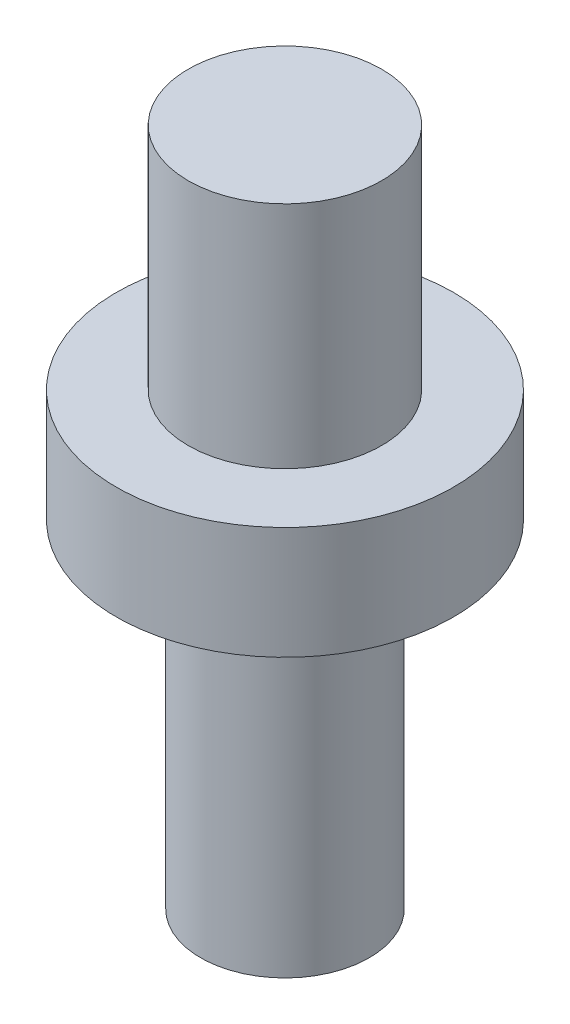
ISO-10303-21;
HEADER;
FILE_DESCRIPTION(('STEP AP214'),'2;1');
FILE_NAME('part.step','',(''),(''),'','','');
FILE_SCHEMA(('AUTOMOTIVE_DESIGN { 1 0 10303 214 1 1 1 1 }'));
ENDSEC;
DATA;
#1=APPLICATION_CONTEXT('core data for automotive mechanical design processes');
#2=APPLICATION_PROTOCOL_DEFINITION('international standard','automotive_design',2000,#1);
#3=PRODUCT_CONTEXT('',#1,'mechanical');
#4=PRODUCT('Part','Part','',(#3));
#5=PRODUCT_RELATED_PRODUCT_CATEGORY('part','',(#4));
#6=PRODUCT_DEFINITION_FORMATION('','',#4);
#7=PRODUCT_DEFINITION_CONTEXT('part definition',#1,'design');
#8=PRODUCT_DEFINITION('design','',#6,#7);
#9=PRODUCT_DEFINITION_SHAPE('','',#8);
#10=(LENGTH_UNIT() NAMED_UNIT(*) SI_UNIT(.MILLI.,.METRE.));
#11=(NAMED_UNIT(*) PLANE_ANGLE_UNIT() SI_UNIT($,.RADIAN.));
#12=(NAMED_UNIT(*) SI_UNIT($,.STERADIAN.) SOLID_ANGLE_UNIT());
#13=UNCERTAINTY_MEASURE_WITH_UNIT(LENGTH_MEASURE(1.E-05),#10,'distance_accuracy_value','');
#14=(GEOMETRIC_REPRESENTATION_CONTEXT(3) GLOBAL_UNCERTAINTY_ASSIGNED_CONTEXT((#13)) GLOBAL_UNIT_ASSIGNED_CONTEXT((#10,
#11,#12)) REPRESENTATION_CONTEXT('',''));
#15=CARTESIAN_POINT('',(0.,0.,0.));
#16=DIRECTION('',(0.,0.,1.));
#17=DIRECTION('',(1.,0.,0.));
#18=AXIS2_PLACEMENT_3D('',#15,#16,#17);
#19=CARTESIAN_POINT('',(0.,0.,0.));
#20=DIRECTION('',(0.,1.,0.));
#21=DIRECTION('',(0.,0.,1.));
#22=AXIS2_PLACEMENT_3D('',#19,#20,#21);
#23=PLANE('',#22);
#24=CARTESIAN_POINT('',(0.,0.,0.));
#25=DIRECTION('',(0.,-1.,0.));
#26=DIRECTION('',(0.,0.,-1.));
#27=AXIS2_PLACEMENT_3D('',#24,#25,#26);
#28=CIRCLE('',#27,5.461);
#29=CARTESIAN_POINT('',(0.,0.,-5.461));
#30=VERTEX_POINT('',#29);
#31=EDGE_CURVE('E10',#30,#30,#28,.T.);
#32=ORIENTED_EDGE('',*,*,#31,.F.);
#33=EDGE_LOOP('',(#32));
#34=FACE_BOUND('',#33,.T.);
#35=ADVANCED_FACE('F45',(#34),#23,.T.);
#36=CARTESIAN_POINT('',(0.,0.,0.));
#37=DIRECTION('',(0.,-1.,0.));
#38=DIRECTION('',(0.,0.,-1.));
#39=AXIS2_PLACEMENT_3D('',#36,#37,#38);
#40=CYLINDRICAL_SURFACE('',#39,5.461);
#41=ORIENTED_EDGE('',*,*,#31,.T.);
#42=EDGE_LOOP('',(#41));
#43=FACE_BOUND('',#42,.T.);
#44=CARTESIAN_POINT('',(0.,-12.954,0.));
#45=DIRECTION('',(0.,-1.,0.));
#46=DIRECTION('',(0.,0.,-1.));
#47=AXIS2_PLACEMENT_3D('',#44,#45,#46);
#48=CIRCLE('',#47,5.461);
#49=CARTESIAN_POINT('',(0.,-12.954,-5.461));
#50=VERTEX_POINT('',#49);
#51=EDGE_CURVE('E52',#50,#50,#48,.T.);
#52=ORIENTED_EDGE('',*,*,#51,.F.);
#53=EDGE_LOOP('',(#52));
#54=FACE_BOUND('',#53,.T.);
#55=ADVANCED_FACE('F100',(#43,#54),#40,.T.);
#56=CARTESIAN_POINT('',(5.461,-12.954,0.));
#57=DIRECTION('',(0.,1.,0.));
#58=DIRECTION('',(0.,0.,1.));
#59=AXIS2_PLACEMENT_3D('',#56,#57,#58);
#60=PLANE('',#59);
#61=ORIENTED_EDGE('',*,*,#51,.T.);
#62=EDGE_LOOP('',(#61));
#63=FACE_BOUND('',#62,.T.);
#64=CARTESIAN_POINT('',(0.,-12.954,0.));
#65=DIRECTION('',(0.,-1.,0.));
#66=DIRECTION('',(0.,0.,-1.));
#67=AXIS2_PLACEMENT_3D('',#64,#65,#66);
#68=CIRCLE('',#67,9.525);
#69=CARTESIAN_POINT('',(0.,-12.954,-9.525));
#70=VERTEX_POINT('',#69);
#71=EDGE_CURVE('E59',#70,#70,#68,.T.);
#72=ORIENTED_EDGE('',*,*,#71,.F.);
#73=EDGE_LOOP('',(#72));
#74=FACE_BOUND('',#73,.T.);
#75=ADVANCED_FACE('F105',(#63,#74),#60,.T.);
#76=CARTESIAN_POINT('',(0.,0.,0.));
#77=DIRECTION('',(0.,-1.,0.));
#78=DIRECTION('',(0.,0.,-1.));
#79=AXIS2_PLACEMENT_3D('',#76,#77,#78);
#80=CYLINDRICAL_SURFACE('',#79,9.525);
#81=ORIENTED_EDGE('',*,*,#71,.T.);
#82=EDGE_LOOP('',(#81));
#83=FACE_BOUND('',#82,.T.);
#84=CARTESIAN_POINT('',(0.,-19.304,0.));
#85=DIRECTION('',(0.,-1.,0.));
#86=DIRECTION('',(0.,0.,-1.));
#87=AXIS2_PLACEMENT_3D('',#84,#85,#86);
#88=CIRCLE('',#87,9.525);
#89=CARTESIAN_POINT('',(0.,-19.304,-9.525));
#90=VERTEX_POINT('',#89);
#91=EDGE_CURVE('E66',#90,#90,#88,.T.);
#92=ORIENTED_EDGE('',*,*,#91,.F.);
#93=EDGE_LOOP('',(#92));
#94=FACE_BOUND('',#93,.T.);
#95=ADVANCED_FACE('F96',(#83,#94),#80,.T.);
#96=CARTESIAN_POINT('',(9.525,-19.304,0.));
#97=DIRECTION('',(0.,-1.,0.));
#98=DIRECTION('',(0.,0.,-1.));
#99=AXIS2_PLACEMENT_3D('',#96,#97,#98);
#100=PLANE('',#99);
#101=ORIENTED_EDGE('',*,*,#91,.T.);
#102=EDGE_LOOP('',(#101));
#103=FACE_BOUND('',#102,.T.);
#104=CARTESIAN_POINT('',(0.,-19.304,0.));
#105=DIRECTION('',(0.,-1.,0.));
#106=DIRECTION('',(0.,0.,-1.));
#107=AXIS2_PLACEMENT_3D('',#104,#105,#106);
#108=CIRCLE('',#107,4.7625);
#109=CARTESIAN_POINT('',(0.,-19.304,-4.7625));
#110=VERTEX_POINT('',#109);
#111=EDGE_CURVE('E72',#110,#110,#108,.T.);
#112=ORIENTED_EDGE('',*,*,#111,.F.);
#113=EDGE_LOOP('',(#112));
#114=FACE_BOUND('',#113,.T.);
#115=ADVANCED_FACE('F87',(#103,#114),#100,.T.);
#116=CARTESIAN_POINT('',(0.,0.,0.));
#117=DIRECTION('',(0.,-1.,0.));
#118=DIRECTION('',(0.,0.,-1.));
#119=AXIS2_PLACEMENT_3D('',#116,#117,#118);
#120=CYLINDRICAL_SURFACE('',#119,4.7625);
#121=ORIENTED_EDGE('',*,*,#111,.T.);
#122=EDGE_LOOP('',(#121));
#123=FACE_BOUND('',#122,.T.);
#124=CARTESIAN_POINT('',(0.,-38.354,0.));
#125=DIRECTION('',(0.,-1.,0.));
#126=DIRECTION('',(0.,0.,-1.));
#127=AXIS2_PLACEMENT_3D('',#124,#125,#126);
#128=CIRCLE('',#127,4.7625);
#129=CARTESIAN_POINT('',(0.,-38.354,-4.7625));
#130=VERTEX_POINT('',#129);
#131=EDGE_CURVE('E76',#130,#130,#128,.T.);
#132=ORIENTED_EDGE('',*,*,#131,.F.);
#133=EDGE_LOOP('',(#132));
#134=FACE_BOUND('',#133,.T.);
#135=ADVANCED_FACE('F85',(#123,#134),#120,.T.);
#136=CARTESIAN_POINT('',(4.7625,-38.354,0.));
#137=DIRECTION('',(0.,-1.,0.));
#138=DIRECTION('',(0.,0.,-1.));
#139=AXIS2_PLACEMENT_3D('',#136,#137,#138);
#140=PLANE('',#139);
#141=ORIENTED_EDGE('',*,*,#131,.T.);
#142=EDGE_LOOP('',(#141));
#143=FACE_BOUND('',#142,.T.);
#144=ADVANCED_FACE('F83',(#143),#140,.T.);
#145=CLOSED_SHELL('',(#35,#55,#75,#95,#115,#135,#144));
#146=MANIFOLD_SOLID_BREP('B2',#145);
#147=ADVANCED_BREP_SHAPE_REPRESENTATION('',(#18,#146),#14);
#148=SHAPE_DEFINITION_REPRESENTATION(#9,#147);
ENDSEC;
END-ISO-10303-21;
